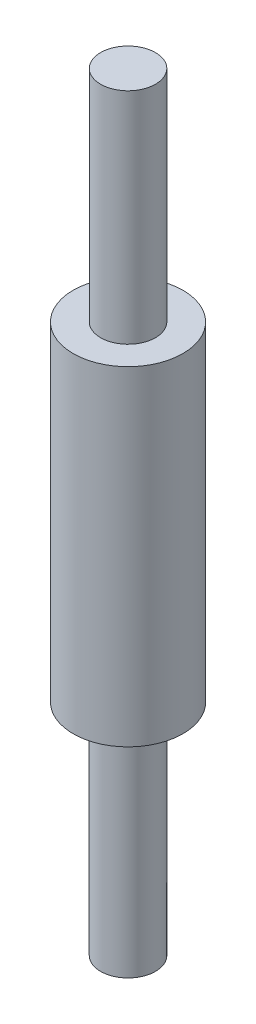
ISO-10303-21;
HEADER;
FILE_DESCRIPTION(('STEP AP214'),'2;1');
FILE_NAME('part.step','',(''),(''),'','','');
FILE_SCHEMA(('AUTOMOTIVE_DESIGN { 1 0 10303 214 1 1 1 1 }'));
ENDSEC;
DATA;
#1=APPLICATION_CONTEXT('core data for automotive mechanical design processes');
#2=APPLICATION_PROTOCOL_DEFINITION('international standard','automotive_design',2000,#1);
#3=PRODUCT_CONTEXT('',#1,'mechanical');
#4=PRODUCT('Part','Part','',(#3));
#5=PRODUCT_RELATED_PRODUCT_CATEGORY('part','',(#4));
#6=PRODUCT_DEFINITION_FORMATION('','',#4);
#7=PRODUCT_DEFINITION_CONTEXT('part definition',#1,'design');
#8=PRODUCT_DEFINITION('design','',#6,#7);
#9=PRODUCT_DEFINITION_SHAPE('','',#8);
#10=(LENGTH_UNIT() NAMED_UNIT(*) SI_UNIT(.MILLI.,.METRE.));
#11=(NAMED_UNIT(*) PLANE_ANGLE_UNIT() SI_UNIT($,.RADIAN.));
#12=(NAMED_UNIT(*) SI_UNIT($,.STERADIAN.) SOLID_ANGLE_UNIT());
#13=UNCERTAINTY_MEASURE_WITH_UNIT(LENGTH_MEASURE(1.E-05),#10,'distance_accuracy_value','');
#14=(GEOMETRIC_REPRESENTATION_CONTEXT(3) GLOBAL_UNCERTAINTY_ASSIGNED_CONTEXT((#13)) GLOBAL_UNIT_ASSIGNED_CONTEXT((#10,
#11,#12)) REPRESENTATION_CONTEXT('',''));
#15=CARTESIAN_POINT('',(0.,0.,0.));
#16=DIRECTION('',(0.,0.,1.));
#17=DIRECTION('',(1.,0.,0.));
#18=AXIS2_PLACEMENT_3D('',#15,#16,#17);
#19=CARTESIAN_POINT('',(0.,88.9,0.));
#20=DIRECTION('',(0.,-1.,0.));
#21=DIRECTION('',(0.,0.,-1.));
#22=AXIS2_PLACEMENT_3D('',#19,#20,#21);
#23=CYLINDRICAL_SURFACE('',#22,6.35);
#24=CARTESIAN_POINT('',(0.,25.4,0.));
#25=DIRECTION('',(0.,-1.,0.));
#26=DIRECTION('',(0.,0.,-1.));
#27=AXIS2_PLACEMENT_3D('',#24,#25,#26);
#28=CIRCLE('',#27,6.35);
#29=CARTESIAN_POINT('',(0.,25.4,-6.35));
#30=VERTEX_POINT('',#29);
#31=EDGE_CURVE('E11',#30,#30,#28,.T.);
#32=ORIENTED_EDGE('',*,*,#31,.F.);
#33=EDGE_LOOP('',(#32));
#34=FACE_BOUND('',#33,.T.);
#35=CARTESIAN_POINT('',(0.,63.5,0.));
#36=DIRECTION('',(0.,1.,0.));
#37=DIRECTION('',(0.,0.,1.));
#38=AXIS2_PLACEMENT_3D('',#35,#36,#37);
#39=CIRCLE('',#38,6.35);
#40=CARTESIAN_POINT('',(0.,63.5,6.35));
#41=VERTEX_POINT('',#40);
#42=EDGE_CURVE('E35',#41,#41,#39,.T.);
#43=ORIENTED_EDGE('',*,*,#42,.F.);
#44=EDGE_LOOP('',(#43));
#45=FACE_BOUND('',#44,.T.);
#46=ADVANCED_FACE('F32',(#34,#45),#23,.T.);
#47=CARTESIAN_POINT('',(0.,25.4,0.));
#48=DIRECTION('',(0.,-1.,0.));
#49=DIRECTION('',(0.,0.,-1.));
#50=AXIS2_PLACEMENT_3D('',#47,#48,#49);
#51=PLANE('',#50);
#52=CARTESIAN_POINT('',(0.,25.4,0.));
#53=DIRECTION('',(0.,-1.,0.));
#54=DIRECTION('',(0.,0.,-1.));
#55=AXIS2_PLACEMENT_3D('',#52,#53,#54);
#56=CIRCLE('',#55,3.175);
#57=CARTESIAN_POINT('',(0.,25.4,-3.175));
#58=VERTEX_POINT('',#57);
#59=EDGE_CURVE('E39',#58,#58,#56,.T.);
#60=ORIENTED_EDGE('',*,*,#59,.F.);
#61=EDGE_LOOP('',(#60));
#62=FACE_BOUND('',#61,.T.);
#63=ORIENTED_EDGE('',*,*,#31,.T.);
#64=EDGE_LOOP('',(#63));
#65=FACE_BOUND('',#64,.T.);
#66=ADVANCED_FACE('F61',(#62,#65),#51,.T.);
#67=CARTESIAN_POINT('',(0.,25.4,0.));
#68=DIRECTION('',(0.,-1.,0.));
#69=DIRECTION('',(0.,0.,-1.));
#70=AXIS2_PLACEMENT_3D('',#67,#68,#69);
#71=CYLINDRICAL_SURFACE('',#70,3.175);
#72=ORIENTED_EDGE('',*,*,#59,.T.);
#73=EDGE_LOOP('',(#72));
#74=FACE_BOUND('',#73,.T.);
#75=CARTESIAN_POINT('',(0.,0.,0.));
#76=DIRECTION('',(0.,-1.,0.));
#77=DIRECTION('',(0.,0.,-1.));
#78=AXIS2_PLACEMENT_3D('',#75,#76,#77);
#79=CIRCLE('',#78,3.175);
#80=CARTESIAN_POINT('',(0.,0.,-3.175));
#81=VERTEX_POINT('',#80);
#82=EDGE_CURVE('E43',#81,#81,#79,.T.);
#83=ORIENTED_EDGE('',*,*,#82,.F.);
#84=EDGE_LOOP('',(#83));
#85=FACE_BOUND('',#84,.T.);
#86=ADVANCED_FACE('F66',(#74,#85),#71,.T.);
#87=CARTESIAN_POINT('',(0.,0.,0.));
#88=DIRECTION('',(0.,1.,0.));
#89=DIRECTION('',(0.,0.,1.));
#90=AXIS2_PLACEMENT_3D('',#87,#88,#89);
#91=PLANE('',#90);
#92=ORIENTED_EDGE('',*,*,#82,.T.);
#93=EDGE_LOOP('',(#92));
#94=FACE_BOUND('',#93,.T.);
#95=ADVANCED_FACE('F72',(#94),#91,.F.);
#96=CARTESIAN_POINT('',(0.,63.5,0.));
#97=DIRECTION('',(0.,1.,0.));
#98=DIRECTION('',(0.,0.,1.));
#99=AXIS2_PLACEMENT_3D('',#96,#97,#98);
#100=PLANE('',#99);
#101=CARTESIAN_POINT('',(0.,63.5,0.));
#102=DIRECTION('',(0.,1.,0.));
#103=DIRECTION('',(0.,0.,1.));
#104=AXIS2_PLACEMENT_3D('',#101,#102,#103);
#105=CIRCLE('',#104,3.175);
#106=CARTESIAN_POINT('',(0.,63.5,3.175));
#107=VERTEX_POINT('',#106);
#108=EDGE_CURVE('E51',#107,#107,#105,.T.);
#109=ORIENTED_EDGE('',*,*,#108,.F.);
#110=EDGE_LOOP('',(#109));
#111=FACE_BOUND('',#110,.T.);
#112=ORIENTED_EDGE('',*,*,#42,.T.);
#113=EDGE_LOOP('',(#112));
#114=FACE_BOUND('',#113,.T.);
#115=ADVANCED_FACE('F58',(#111,#114),#100,.T.);
#116=CARTESIAN_POINT('',(0.,63.5,0.));
#117=DIRECTION('',(0.,1.,0.));
#118=DIRECTION('',(0.,0.,1.));
#119=AXIS2_PLACEMENT_3D('',#116,#117,#118);
#120=CYLINDRICAL_SURFACE('',#119,3.175);
#121=ORIENTED_EDGE('',*,*,#108,.T.);
#122=EDGE_LOOP('',(#121));
#123=FACE_BOUND('',#122,.T.);
#124=CARTESIAN_POINT('',(0.,88.9,0.));
#125=DIRECTION('',(0.,1.,0.));
#126=DIRECTION('',(0.,0.,1.));
#127=AXIS2_PLACEMENT_3D('',#124,#125,#126);
#128=CIRCLE('',#127,3.175);
#129=CARTESIAN_POINT('',(0.,88.9,3.175));
#130=VERTEX_POINT('',#129);
#131=EDGE_CURVE('E48',#130,#130,#128,.T.);
#132=ORIENTED_EDGE('',*,*,#131,.F.);
#133=EDGE_LOOP('',(#132));
#134=FACE_BOUND('',#133,.T.);
#135=ADVANCED_FACE('F80',(#123,#134),#120,.T.);
#136=CARTESIAN_POINT('',(0.,88.9,0.));
#137=DIRECTION('',(0.,1.,0.));
#138=DIRECTION('',(0.,0.,1.));
#139=AXIS2_PLACEMENT_3D('',#136,#137,#138);
#140=PLANE('',#139);
#141=ORIENTED_EDGE('',*,*,#131,.T.);
#142=EDGE_LOOP('',(#141));
#143=FACE_BOUND('',#142,.T.);
#144=ADVANCED_FACE('F78',(#143),#140,.T.);
#145=CLOSED_SHELL('',(#46,#66,#86,#95,#115,#135,#144));
#146=MANIFOLD_SOLID_BREP('B2',#145);
#147=ADVANCED_BREP_SHAPE_REPRESENTATION('',(#18,#146),#14);
#148=SHAPE_DEFINITION_REPRESENTATION(#9,#147);
ENDSEC;
END-ISO-10303-21;
